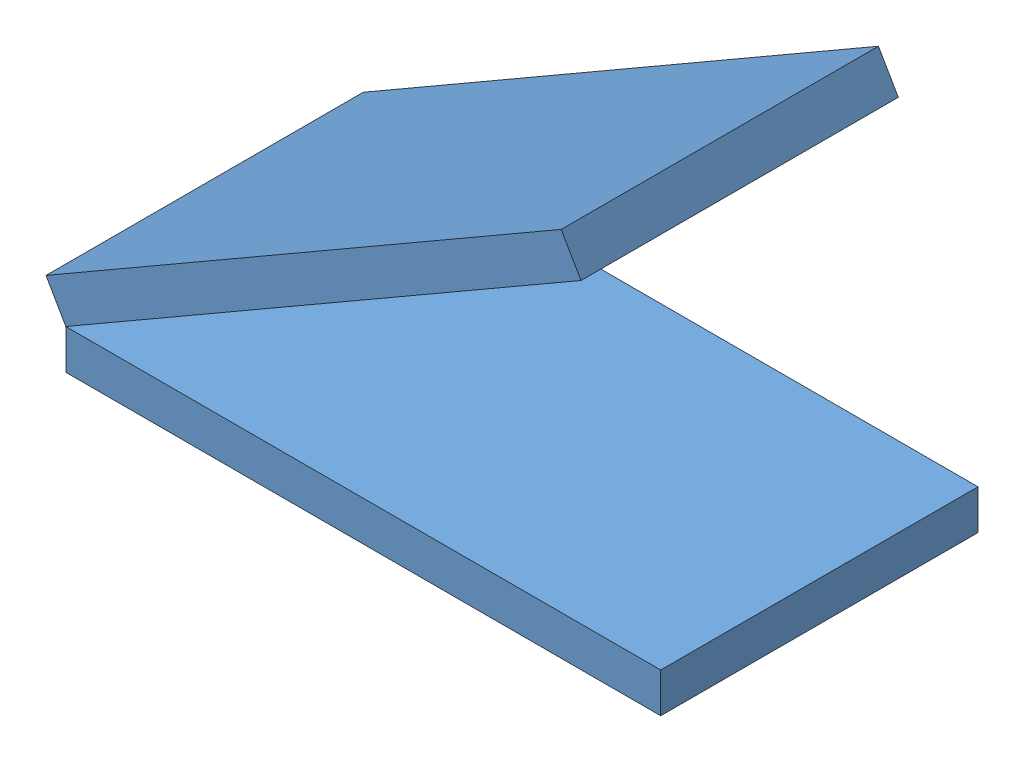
SolidWorks assembly Angle Constraint with reference entity.SLDASM, configuration Default (file format 8000). Lengths in mm.
Overall size (155 93.66 80).
2 component instances, 1 part files, 3 mates.
Components (placement in the parent):
- Part 1-1: Part 1.SLDPRT [Default] at (67.4195 59.3077 118.5985) size (150 10 80)
- Part 1-2: Part 1.SLDPRT [Default] at (57.3714 106.8077 118.5985) x (0.866025 0.5 0) z (0 0 1) size (150 10 80)
Mates (geometry in assembly coordinates):
- Coincident1: coincident aligned: plane of Part 1-1 through (-7.5805 69.3077 158.5985) normal (0 0 1); plane of Part 1-2 through (-14.6515 76.3788 158.5985) normal (0 0 1)
- Coincident2: coincident aligned: line of Part 1-1 through (-7.5805 69.3077 78.5985) axis (0 0 1); line of Part 1-2 through (-7.5805 69.3077 78.5985) axis (0 0 1)
- Angle1: planar angle = 0.523599 rad anti-aligned: plane of Part 1-2 through (57.3714 106.8077 118.5985) normal (0.5 -0.866025 0); plane of Part 1-1 through (67.4195 69.3077 118.5985) normal (0 1 0); line of Part 1-1 through (-7.5805 69.3077 78.5985) axis (0 0 1)
